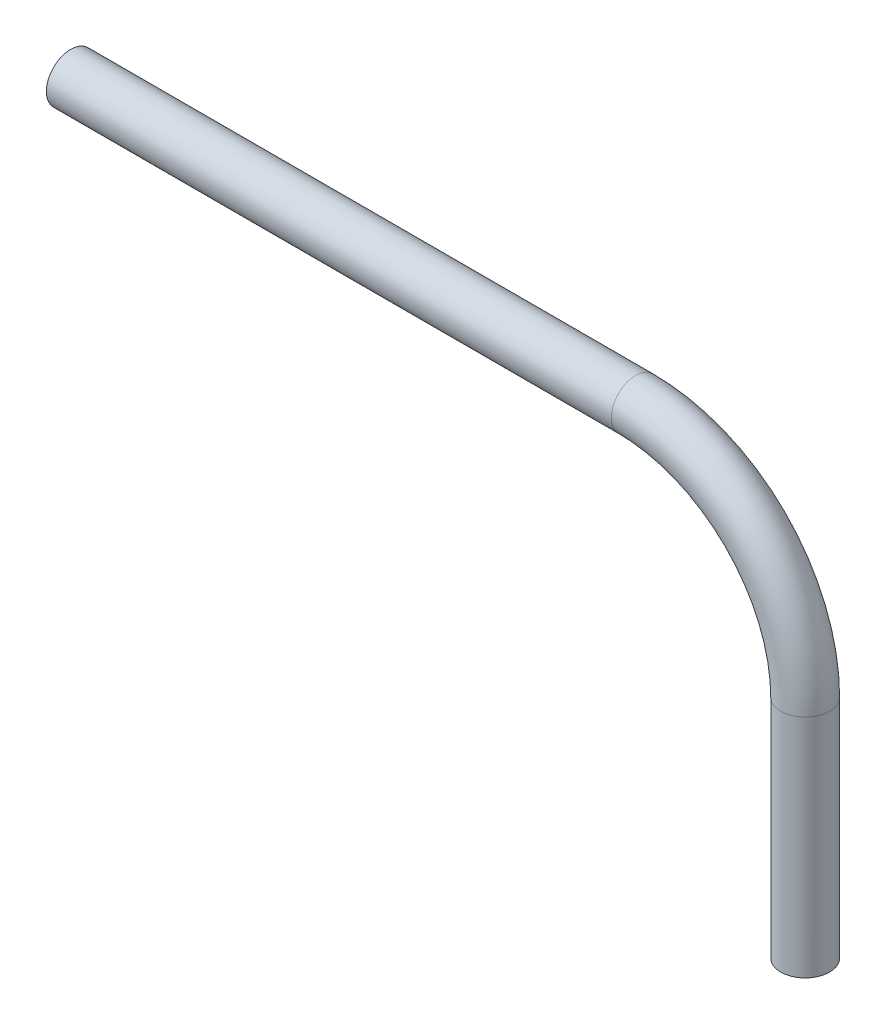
ISO-10303-21;
HEADER;
FILE_DESCRIPTION(('STEP AP214'),'2;1');
FILE_NAME('part.step','',(''),(''),'','','');
FILE_SCHEMA(('AUTOMOTIVE_DESIGN { 1 0 10303 214 1 1 1 1 }'));
ENDSEC;
DATA;
#1=APPLICATION_CONTEXT('core data for automotive mechanical design processes');
#2=APPLICATION_PROTOCOL_DEFINITION('international standard','automotive_design',2000,#1);
#3=PRODUCT_CONTEXT('',#1,'mechanical');
#4=PRODUCT('Part','Part','',(#3));
#5=PRODUCT_RELATED_PRODUCT_CATEGORY('part','',(#4));
#6=PRODUCT_DEFINITION_FORMATION('','',#4);
#7=PRODUCT_DEFINITION_CONTEXT('part definition',#1,'design');
#8=PRODUCT_DEFINITION('design','',#6,#7);
#9=PRODUCT_DEFINITION_SHAPE('','',#8);
#10=(LENGTH_UNIT() NAMED_UNIT(*) SI_UNIT(.MILLI.,.METRE.));
#11=(NAMED_UNIT(*) PLANE_ANGLE_UNIT() SI_UNIT($,.RADIAN.));
#12=(NAMED_UNIT(*) SI_UNIT($,.STERADIAN.) SOLID_ANGLE_UNIT());
#13=UNCERTAINTY_MEASURE_WITH_UNIT(LENGTH_MEASURE(1.E-05),#10,'distance_accuracy_value','');
#14=(GEOMETRIC_REPRESENTATION_CONTEXT(3) GLOBAL_UNCERTAINTY_ASSIGNED_CONTEXT((#13)) GLOBAL_UNIT_ASSIGNED_CONTEXT((#10,
#11,#12)) REPRESENTATION_CONTEXT('',''));
#15=CARTESIAN_POINT('',(0.,0.,0.));
#16=DIRECTION('',(0.,0.,1.));
#17=DIRECTION('',(1.,0.,0.));
#18=AXIS2_PLACEMENT_3D('',#15,#16,#17);
#19=CARTESIAN_POINT('',(0.,0.,0.));
#20=DIRECTION('',(0.,1.,0.));
#21=DIRECTION('',(-1.,0.,0.));
#22=AXIS2_PLACEMENT_3D('',#19,#20,#21);
#23=CYLINDRICAL_SURFACE('',#22,14.5);
#24=CARTESIAN_POINT('',(0.,0.,0.));
#25=DIRECTION('',(0.,1.,0.));
#26=DIRECTION('',(-1.,0.,0.));
#27=AXIS2_PLACEMENT_3D('',#24,#25,#26);
#28=CIRCLE('',#27,14.5);
#29=CARTESIAN_POINT('',(-14.5,0.,0.));
#30=VERTEX_POINT('',#29);
#31=EDGE_CURVE('E18',#30,#30,#28,.F.);
#32=ORIENTED_EDGE('',*,*,#31,.T.);
#33=EDGE_LOOP('',(#32));
#34=FACE_BOUND('',#33,.T.);
#35=CARTESIAN_POINT('',(0.,160.,0.));
#36=DIRECTION('',(0.,1.,0.));
#37=DIRECTION('',(1.,0.,0.));
#38=AXIS2_PLACEMENT_3D('',#35,#36,#37);
#39=CIRCLE('',#38,14.5);
#40=CARTESIAN_POINT('',(14.5,160.,0.));
#41=VERTEX_POINT('',#40);
#42=EDGE_CURVE('E66',#41,#41,#39,.T.);
#43=ORIENTED_EDGE('',*,*,#42,.T.);
#44=EDGE_LOOP('',(#43));
#45=FACE_BOUND('',#44,.T.);
#46=ADVANCED_FACE('F15',(#34,#45),#23,.F.);
#47=CARTESIAN_POINT('',(-120.,160.,0.));
#48=DIRECTION('',(0.,0.,1.));
#49=DIRECTION('',(1.,0.,0.));
#50=AXIS2_PLACEMENT_3D('',#47,#48,#49);
#51=TOROIDAL_SURFACE('',#50,120.,14.5);
#52=ORIENTED_EDGE('',*,*,#42,.F.);
#53=EDGE_LOOP('',(#52));
#54=FACE_BOUND('',#53,.T.);
#55=CARTESIAN_POINT('',(-120.,280.,0.));
#56=DIRECTION('',(-1.,0.,0.));
#57=DIRECTION('',(0.,-1.,0.));
#58=AXIS2_PLACEMENT_3D('',#55,#56,#57);
#59=CIRCLE('',#58,14.5);
#60=CARTESIAN_POINT('',(-120.,265.5,0.));
#61=VERTEX_POINT('',#60);
#62=EDGE_CURVE('E75',#61,#61,#59,.T.);
#63=ORIENTED_EDGE('',*,*,#62,.T.);
#64=EDGE_LOOP('',(#63));
#65=FACE_BOUND('',#64,.T.);
#66=ADVANCED_FACE('F56',(#54,#65),#51,.F.);
#67=CARTESIAN_POINT('',(0.,0.,0.));
#68=DIRECTION('',(0.,1.,0.));
#69=DIRECTION('',(0.,0.,1.));
#70=AXIS2_PLACEMENT_3D('',#67,#68,#69);
#71=PLANE('',#70);
#72=CARTESIAN_POINT('',(0.,0.,0.));
#73=DIRECTION('',(0.,1.,0.));
#74=DIRECTION('',(-1.,0.,0.));
#75=AXIS2_PLACEMENT_3D('',#72,#73,#74);
#76=CIRCLE('',#75,17.25);
#77=CARTESIAN_POINT('',(-17.25,0.,0.));
#78=VERTEX_POINT('',#77);
#79=EDGE_CURVE('E73',#78,#78,#76,.T.);
#80=ORIENTED_EDGE('',*,*,#79,.F.);
#81=EDGE_LOOP('',(#80));
#82=FACE_BOUND('',#81,.T.);
#83=ORIENTED_EDGE('',*,*,#31,.F.);
#84=EDGE_LOOP('',(#83));
#85=FACE_BOUND('',#84,.T.);
#86=ADVANCED_FACE('F53',(#82,#85),#71,.F.);
#87=CARTESIAN_POINT('',(-120.,280.,0.));
#88=DIRECTION('',(-1.,0.,0.));
#89=DIRECTION('',(0.,-1.,0.));
#90=AXIS2_PLACEMENT_3D('',#87,#88,#89);
#91=CYLINDRICAL_SURFACE('',#90,14.5);
#92=ORIENTED_EDGE('',*,*,#62,.F.);
#93=EDGE_LOOP('',(#92));
#94=FACE_BOUND('',#93,.T.);
#95=CARTESIAN_POINT('',(-520.,280.,0.));
#96=DIRECTION('',(-1.,0.,0.));
#97=DIRECTION('',(0.,-1.,0.));
#98=AXIS2_PLACEMENT_3D('',#95,#96,#97);
#99=CIRCLE('',#98,14.5);
#100=CARTESIAN_POINT('',(-520.,265.5,0.));
#101=VERTEX_POINT('',#100);
#102=EDGE_CURVE('E71',#101,#101,#99,.F.);
#103=ORIENTED_EDGE('',*,*,#102,.F.);
#104=EDGE_LOOP('',(#103));
#105=FACE_BOUND('',#104,.T.);
#106=ADVANCED_FACE('F49',(#94,#105),#91,.F.);
#107=CARTESIAN_POINT('',(0.,0.,0.));
#108=DIRECTION('',(0.,1.,0.));
#109=DIRECTION('',(-1.,0.,0.));
#110=AXIS2_PLACEMENT_3D('',#107,#108,#109);
#111=CYLINDRICAL_SURFACE('',#110,17.25);
#112=ORIENTED_EDGE('',*,*,#79,.T.);
#113=EDGE_LOOP('',(#112));
#114=FACE_BOUND('',#113,.T.);
#115=CARTESIAN_POINT('',(0.,160.,0.));
#116=DIRECTION('',(0.,1.,0.));
#117=DIRECTION('',(1.,0.,0.));
#118=AXIS2_PLACEMENT_3D('',#115,#116,#117);
#119=CIRCLE('',#118,17.25);
#120=CARTESIAN_POINT('',(17.25,160.,0.));
#121=VERTEX_POINT('',#120);
#122=EDGE_CURVE('E27',#121,#121,#119,.T.);
#123=ORIENTED_EDGE('',*,*,#122,.F.);
#124=EDGE_LOOP('',(#123));
#125=FACE_BOUND('',#124,.T.);
#126=ADVANCED_FACE('F45',(#114,#125),#111,.T.);
#127=CARTESIAN_POINT('',(-520.,280.,0.));
#128=DIRECTION('',(-1.,0.,0.));
#129=DIRECTION('',(0.,-1.,0.));
#130=AXIS2_PLACEMENT_3D('',#127,#128,#129);
#131=PLANE('',#130);
#132=CARTESIAN_POINT('',(-520.,280.,0.));
#133=DIRECTION('',(-1.,0.,0.));
#134=DIRECTION('',(0.,-1.,0.));
#135=AXIS2_PLACEMENT_3D('',#132,#133,#134);
#136=CIRCLE('',#135,17.25);
#137=CARTESIAN_POINT('',(-520.,262.75,0.));
#138=VERTEX_POINT('',#137);
#139=EDGE_CURVE('E22',#138,#138,#136,.F.);
#140=ORIENTED_EDGE('',*,*,#139,.F.);
#141=EDGE_LOOP('',(#140));
#142=FACE_BOUND('',#141,.T.);
#143=ORIENTED_EDGE('',*,*,#102,.T.);
#144=EDGE_LOOP('',(#143));
#145=FACE_BOUND('',#144,.T.);
#146=ADVANCED_FACE('F41',(#142,#145),#131,.T.);
#147=CARTESIAN_POINT('',(-120.,160.,0.));
#148=DIRECTION('',(0.,0.,1.));
#149=DIRECTION('',(1.,0.,0.));
#150=AXIS2_PLACEMENT_3D('',#147,#148,#149);
#151=TOROIDAL_SURFACE('',#150,120.,17.25);
#152=ORIENTED_EDGE('',*,*,#122,.T.);
#153=EDGE_LOOP('',(#152));
#154=FACE_BOUND('',#153,.T.);
#155=CARTESIAN_POINT('',(-120.,280.,0.));
#156=DIRECTION('',(-1.,0.,0.));
#157=DIRECTION('',(0.,-1.,0.));
#158=AXIS2_PLACEMENT_3D('',#155,#156,#157);
#159=CIRCLE('',#158,17.25);
#160=CARTESIAN_POINT('',(-120.,262.75,0.));
#161=VERTEX_POINT('',#160);
#162=EDGE_CURVE('E10',#161,#161,#159,.T.);
#163=ORIENTED_EDGE('',*,*,#162,.F.);
#164=EDGE_LOOP('',(#163));
#165=FACE_BOUND('',#164,.T.);
#166=ADVANCED_FACE('F36',(#154,#165),#151,.T.);
#167=CARTESIAN_POINT('',(-120.,280.,0.));
#168=DIRECTION('',(-1.,0.,0.));
#169=DIRECTION('',(0.,-1.,0.));
#170=AXIS2_PLACEMENT_3D('',#167,#168,#169);
#171=CYLINDRICAL_SURFACE('',#170,17.25);
#172=ORIENTED_EDGE('',*,*,#162,.T.);
#173=EDGE_LOOP('',(#172));
#174=FACE_BOUND('',#173,.T.);
#175=ORIENTED_EDGE('',*,*,#139,.T.);
#176=EDGE_LOOP('',(#175));
#177=FACE_BOUND('',#176,.T.);
#178=ADVANCED_FACE('F40',(#174,#177),#171,.T.);
#179=CLOSED_SHELL('',(#46,#66,#86,#106,#126,#146,#166,#178));
#180=MANIFOLD_SOLID_BREP('B1',#179);
#181=ADVANCED_BREP_SHAPE_REPRESENTATION('',(#18,#180),#14);
#182=SHAPE_DEFINITION_REPRESENTATION(#9,#181);
ENDSEC;
END-ISO-10303-21;
